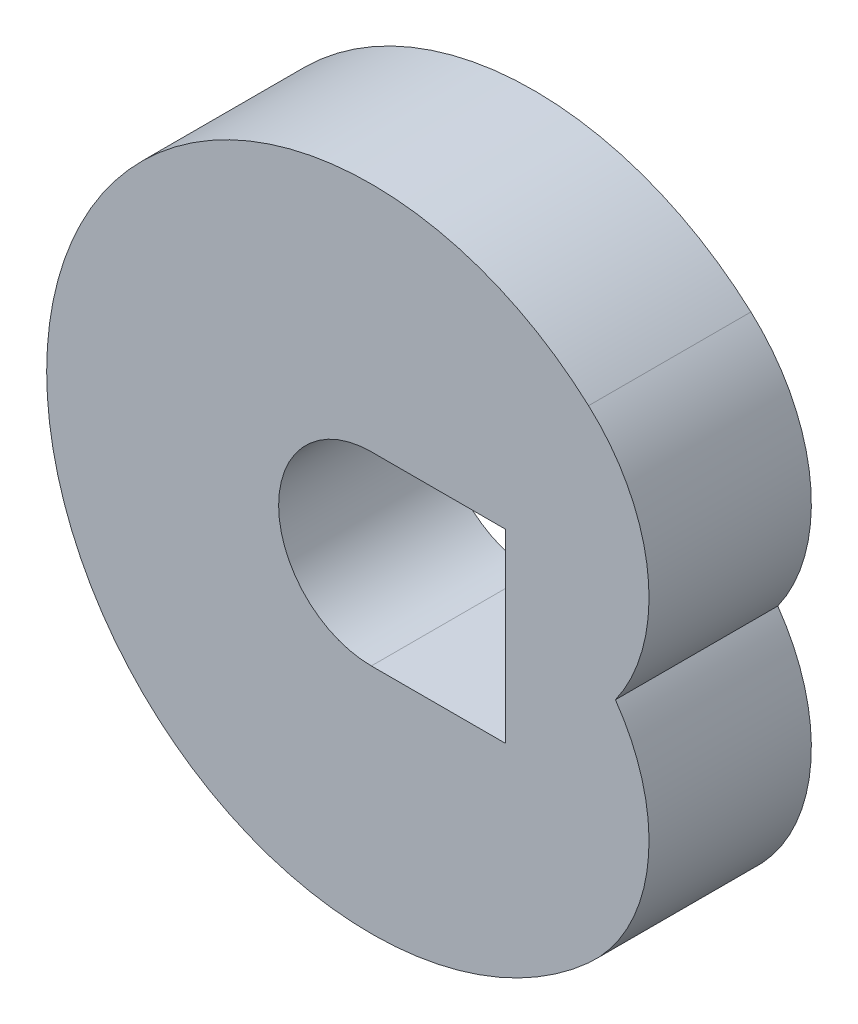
ISO-10303-21;
HEADER;
FILE_DESCRIPTION(('STEP AP214'),'2;1');
FILE_NAME('part.step','',(''),(''),'','','');
FILE_SCHEMA(('AUTOMOTIVE_DESIGN { 1 0 10303 214 1 1 1 1 }'));
ENDSEC;
DATA;
#1=APPLICATION_CONTEXT('core data for automotive mechanical design processes');
#2=APPLICATION_PROTOCOL_DEFINITION('international standard','automotive_design',2000,#1);
#3=PRODUCT_CONTEXT('',#1,'mechanical');
#4=PRODUCT('Part','Part','',(#3));
#5=PRODUCT_RELATED_PRODUCT_CATEGORY('part','',(#4));
#6=PRODUCT_DEFINITION_FORMATION('','',#4);
#7=PRODUCT_DEFINITION_CONTEXT('part definition',#1,'design');
#8=PRODUCT_DEFINITION('design','',#6,#7);
#9=PRODUCT_DEFINITION_SHAPE('','',#8);
#10=(LENGTH_UNIT() NAMED_UNIT(*) SI_UNIT(.MILLI.,.METRE.));
#11=(NAMED_UNIT(*) PLANE_ANGLE_UNIT() SI_UNIT($,.RADIAN.));
#12=(NAMED_UNIT(*) SI_UNIT($,.STERADIAN.) SOLID_ANGLE_UNIT());
#13=UNCERTAINTY_MEASURE_WITH_UNIT(LENGTH_MEASURE(1.E-05),#10,'distance_accuracy_value','');
#14=(GEOMETRIC_REPRESENTATION_CONTEXT(3) GLOBAL_UNCERTAINTY_ASSIGNED_CONTEXT((#13)) GLOBAL_UNIT_ASSIGNED_CONTEXT((#10,
#11,#12)) REPRESENTATION_CONTEXT('',''));
#15=CARTESIAN_POINT('',(0.,0.,0.));
#16=DIRECTION('',(0.,0.,1.));
#17=DIRECTION('',(1.,0.,0.));
#18=AXIS2_PLACEMENT_3D('',#15,#16,#17);
#19=CARTESIAN_POINT('',(234.195712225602,0.,400.));
#20=DIRECTION('',(0.,0.,-1.));
#21=DIRECTION('',(-1.,0.,0.));
#22=AXIS2_PLACEMENT_3D('',#19,#20,#21);
#23=PLANE('',#22);
#24=CARTESIAN_POINT('',(234.195712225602,260.100688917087,400.));
#25=DIRECTION('',(0.,0.,-1.));
#26=DIRECTION('',(-1.,0.,0.));
#27=AXIS2_PLACEMENT_3D('',#24,#25,#26);
#28=CIRCLE('',#27,450.);
#29=CARTESIAN_POINT('',(535.304485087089,594.515860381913,400.));
#30=VERTEX_POINT('',#29);
#31=CARTESIAN_POINT('',(601.411768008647,-1.11022302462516E-13,400.));
#32=VERTEX_POINT('',#31);
#33=EDGE_CURVE('E155',#30,#32,#28,.T.);
#34=ORIENTED_EDGE('',*,*,#33,.F.);
#35=CARTESIAN_POINT('',(0.,0.,400.));
#36=DIRECTION('',(0.,0.,1.));
#37=DIRECTION('',(1.,0.,0.));
#38=AXIS2_PLACEMENT_3D('',#35,#36,#37);
#39=CIRCLE('',#38,800.);
#40=CARTESIAN_POINT('',(535.304485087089,-594.515860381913,400.));
#41=VERTEX_POINT('',#40);
#42=EDGE_CURVE('E161',#30,#41,#39,.T.);
#43=ORIENTED_EDGE('',*,*,#42,.T.);
#44=CARTESIAN_POINT('',(234.195712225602,-260.100688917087,400.));
#45=DIRECTION('',(0.,0.,1.));
#46=DIRECTION('',(1.,0.,0.));
#47=AXIS2_PLACEMENT_3D('',#44,#45,#46);
#48=CIRCLE('',#47,450.);
#49=EDGE_CURVE('E158',#41,#32,#48,.T.);
#50=ORIENTED_EDGE('',*,*,#49,.T.);
#51=EDGE_LOOP('',(#34,#43,#50));
#52=FACE_BOUND('',#51,.T.);
#53=CARTESIAN_POINT('',(0.,0.,400.));
#54=DIRECTION('',(0.,0.,1.));
#55=DIRECTION('',(1.,0.,0.));
#56=AXIS2_PLACEMENT_3D('',#53,#54,#55);
#57=CIRCLE('',#56,228.477565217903);
#58=CARTESIAN_POINT('',(0.,228.477565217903,400.));
#59=VERTEX_POINT('',#58);
#60=CARTESIAN_POINT('',(0.,-228.477565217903,400.));
#61=VERTEX_POINT('',#60);
#62=EDGE_CURVE('E118',#59,#61,#57,.T.);
#63=ORIENTED_EDGE('',*,*,#62,.F.);
#64=DIRECTION('',(1.,0.,0.));
#65=VECTOR('',#64,1.);
#66=CARTESIAN_POINT('',(0.,228.477565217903,400.));
#67=LINE('',#66,#65);
#68=CARTESIAN_POINT('',(330.,228.477565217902,400.));
#69=VERTEX_POINT('',#68);
#70=EDGE_CURVE('E140',#59,#69,#67,.T.);
#71=ORIENTED_EDGE('',*,*,#70,.T.);
#72=DIRECTION('',(0.,-1.,0.));
#73=VECTOR('',#72,1.);
#74=CARTESIAN_POINT('',(330.,228.477565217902,400.));
#75=LINE('',#74,#73);
#76=CARTESIAN_POINT('',(330.,-228.477565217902,400.));
#77=VERTEX_POINT('',#76);
#78=EDGE_CURVE('E77',#69,#77,#75,.T.);
#79=ORIENTED_EDGE('',*,*,#78,.T.);
#80=DIRECTION('',(-1.,0.,0.));
#81=VECTOR('',#80,1.);
#82=CARTESIAN_POINT('',(330.,-228.477565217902,400.));
#83=LINE('',#82,#81);
#84=EDGE_CURVE('E128',#77,#61,#83,.T.);
#85=ORIENTED_EDGE('',*,*,#84,.T.);
#86=EDGE_LOOP('',(#63,#71,#79,#85));
#87=FACE_BOUND('',#86,.T.);
#88=ADVANCED_FACE('F60',(#52,#87),#23,.F.);
#89=CARTESIAN_POINT('',(234.195712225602,0.,0.));
#90=DIRECTION('',(0.,0.,-1.));
#91=DIRECTION('',(-1.,0.,0.));
#92=AXIS2_PLACEMENT_3D('',#89,#90,#91);
#93=PLANE('',#92);
#94=CARTESIAN_POINT('',(234.195712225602,260.100688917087,0.));
#95=DIRECTION('',(0.,0.,-1.));
#96=DIRECTION('',(-1.,0.,0.));
#97=AXIS2_PLACEMENT_3D('',#94,#95,#96);
#98=CIRCLE('',#97,450.);
#99=CARTESIAN_POINT('',(535.304485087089,594.515860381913,0.));
#100=VERTEX_POINT('',#99);
#101=CARTESIAN_POINT('',(601.411768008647,-1.11022302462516E-13,0.));
#102=VERTEX_POINT('',#101);
#103=EDGE_CURVE('E136',#100,#102,#98,.T.);
#104=ORIENTED_EDGE('',*,*,#103,.T.);
#105=CARTESIAN_POINT('',(234.195712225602,-260.100688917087,0.));
#106=DIRECTION('',(0.,0.,1.));
#107=DIRECTION('',(1.,0.,0.));
#108=AXIS2_PLACEMENT_3D('',#105,#106,#107);
#109=CIRCLE('',#108,450.);
#110=CARTESIAN_POINT('',(535.304485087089,-594.515860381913,0.));
#111=VERTEX_POINT('',#110);
#112=EDGE_CURVE('E165',#111,#102,#109,.T.);
#113=ORIENTED_EDGE('',*,*,#112,.F.);
#114=CARTESIAN_POINT('',(0.,0.,0.));
#115=DIRECTION('',(0.,0.,1.));
#116=DIRECTION('',(1.,0.,0.));
#117=AXIS2_PLACEMENT_3D('',#114,#115,#116);
#118=CIRCLE('',#117,800.);
#119=EDGE_CURVE('E159',#100,#111,#118,.T.);
#120=ORIENTED_EDGE('',*,*,#119,.F.);
#121=EDGE_LOOP('',(#104,#113,#120));
#122=FACE_BOUND('',#121,.T.);
#123=DIRECTION('',(1.,0.,0.));
#124=VECTOR('',#123,1.);
#125=CARTESIAN_POINT('',(0.,228.477565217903,0.));
#126=LINE('',#125,#124);
#127=CARTESIAN_POINT('',(0.,228.477565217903,0.));
#128=VERTEX_POINT('',#127);
#129=CARTESIAN_POINT('',(330.,228.477565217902,0.));
#130=VERTEX_POINT('',#129);
#131=EDGE_CURVE('E129',#128,#130,#126,.T.);
#132=ORIENTED_EDGE('',*,*,#131,.F.);
#133=CARTESIAN_POINT('',(0.,0.,0.));
#134=DIRECTION('',(0.,0.,1.));
#135=DIRECTION('',(1.,0.,0.));
#136=AXIS2_PLACEMENT_3D('',#133,#134,#135);
#137=CIRCLE('',#136,228.477565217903);
#138=CARTESIAN_POINT('',(0.,-228.477565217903,0.));
#139=VERTEX_POINT('',#138);
#140=EDGE_CURVE('E85',#128,#139,#137,.T.);
#141=ORIENTED_EDGE('',*,*,#140,.T.);
#142=DIRECTION('',(-1.,0.,0.));
#143=VECTOR('',#142,1.);
#144=CARTESIAN_POINT('',(330.,-228.477565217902,0.));
#145=LINE('',#144,#143);
#146=CARTESIAN_POINT('',(330.,-228.477565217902,0.));
#147=VERTEX_POINT('',#146);
#148=EDGE_CURVE('E135',#147,#139,#145,.T.);
#149=ORIENTED_EDGE('',*,*,#148,.F.);
#150=DIRECTION('',(0.,-1.,0.));
#151=VECTOR('',#150,1.);
#152=CARTESIAN_POINT('',(330.,228.477565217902,0.));
#153=LINE('',#152,#151);
#154=EDGE_CURVE('E146',#130,#147,#153,.T.);
#155=ORIENTED_EDGE('',*,*,#154,.F.);
#156=EDGE_LOOP('',(#132,#141,#149,#155));
#157=FACE_BOUND('',#156,.T.);
#158=ADVANCED_FACE('F180',(#122,#157),#93,.T.);
#159=CARTESIAN_POINT('',(234.195712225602,260.100688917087,400.));
#160=DIRECTION('',(0.,0.,-1.));
#161=DIRECTION('',(-1.,0.,0.));
#162=AXIS2_PLACEMENT_3D('',#159,#160,#161);
#163=CYLINDRICAL_SURFACE('',#162,450.);
#164=ORIENTED_EDGE('',*,*,#103,.F.);
#165=DIRECTION('',(0.,0.,-1.));
#166=VECTOR('',#165,1.);
#167=CARTESIAN_POINT('',(535.304485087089,594.515860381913,400.));
#168=LINE('',#167,#166);
#169=EDGE_CURVE('E12',#30,#100,#168,.T.);
#170=ORIENTED_EDGE('',*,*,#169,.F.);
#171=ORIENTED_EDGE('',*,*,#33,.T.);
#172=DIRECTION('',(0.,0.,-1.));
#173=VECTOR('',#172,1.);
#174=CARTESIAN_POINT('',(601.411768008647,-1.11022302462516E-13,400.));
#175=LINE('',#174,#173);
#176=EDGE_CURVE('E64',#32,#102,#175,.T.);
#177=ORIENTED_EDGE('',*,*,#176,.T.);
#178=EDGE_LOOP('',(#164,#170,#171,#177));
#179=FACE_BOUND('',#178,.T.);
#180=ADVANCED_FACE('F62',(#179),#163,.T.);
#181=CARTESIAN_POINT('',(0.,0.,400.));
#182=DIRECTION('',(0.,0.,-1.));
#183=DIRECTION('',(-1.,0.,0.));
#184=AXIS2_PLACEMENT_3D('',#181,#182,#183);
#185=CYLINDRICAL_SURFACE('',#184,800.);
#186=ORIENTED_EDGE('',*,*,#119,.T.);
#187=DIRECTION('',(0.,0.,-1.));
#188=VECTOR('',#187,1.);
#189=CARTESIAN_POINT('',(535.304485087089,-594.515860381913,400.));
#190=LINE('',#189,#188);
#191=EDGE_CURVE('E69',#41,#111,#190,.T.);
#192=ORIENTED_EDGE('',*,*,#191,.F.);
#193=ORIENTED_EDGE('',*,*,#42,.F.);
#194=ORIENTED_EDGE('',*,*,#169,.T.);
#195=EDGE_LOOP('',(#186,#192,#193,#194));
#196=FACE_BOUND('',#195,.T.);
#197=ADVANCED_FACE('F183',(#196),#185,.T.);
#198=CARTESIAN_POINT('',(234.195712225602,-260.100688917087,400.));
#199=DIRECTION('',(0.,0.,-1.));
#200=DIRECTION('',(-1.,0.,0.));
#201=AXIS2_PLACEMENT_3D('',#198,#199,#200);
#202=CYLINDRICAL_SURFACE('',#201,450.);
#203=ORIENTED_EDGE('',*,*,#112,.T.);
#204=ORIENTED_EDGE('',*,*,#176,.F.);
#205=ORIENTED_EDGE('',*,*,#49,.F.);
#206=ORIENTED_EDGE('',*,*,#191,.T.);
#207=EDGE_LOOP('',(#203,#204,#205,#206));
#208=FACE_BOUND('',#207,.T.);
#209=ADVANCED_FACE('F177',(#208),#202,.T.);
#210=CARTESIAN_POINT('',(0.,0.,400.));
#211=DIRECTION('',(0.,0.,-1.));
#212=DIRECTION('',(-1.,0.,0.));
#213=AXIS2_PLACEMENT_3D('',#210,#211,#212);
#214=CYLINDRICAL_SURFACE('',#213,228.477565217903);
#215=ORIENTED_EDGE('',*,*,#140,.F.);
#216=DIRECTION('',(0.,0.,-1.));
#217=VECTOR('',#216,1.);
#218=CARTESIAN_POINT('',(0.,228.477565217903,400.));
#219=LINE('',#218,#217);
#220=EDGE_CURVE('E123',#59,#128,#219,.T.);
#221=ORIENTED_EDGE('',*,*,#220,.F.);
#222=ORIENTED_EDGE('',*,*,#62,.T.);
#223=DIRECTION('',(0.,0.,-1.));
#224=VECTOR('',#223,1.);
#225=CARTESIAN_POINT('',(0.,-228.477565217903,400.));
#226=LINE('',#225,#224);
#227=EDGE_CURVE('E121',#61,#139,#226,.T.);
#228=ORIENTED_EDGE('',*,*,#227,.T.);
#229=EDGE_LOOP('',(#215,#221,#222,#228));
#230=FACE_BOUND('',#229,.T.);
#231=ADVANCED_FACE('F120',(#230),#214,.F.);
#232=CARTESIAN_POINT('',(330.,-228.477565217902,400.));
#233=DIRECTION('',(0.,-1.,0.));
#234=DIRECTION('',(1.,0.,0.));
#235=AXIS2_PLACEMENT_3D('',#232,#233,#234);
#236=PLANE('',#235);
#237=ORIENTED_EDGE('',*,*,#148,.T.);
#238=ORIENTED_EDGE('',*,*,#227,.F.);
#239=ORIENTED_EDGE('',*,*,#84,.F.);
#240=DIRECTION('',(0.,0.,-1.));
#241=VECTOR('',#240,1.);
#242=CARTESIAN_POINT('',(330.,-228.477565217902,400.));
#243=LINE('',#242,#241);
#244=EDGE_CURVE('E137',#77,#147,#243,.T.);
#245=ORIENTED_EDGE('',*,*,#244,.T.);
#246=EDGE_LOOP('',(#237,#238,#239,#245));
#247=FACE_BOUND('',#246,.T.);
#248=ADVANCED_FACE('F133',(#247),#236,.F.);
#249=CARTESIAN_POINT('',(330.,228.477565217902,400.));
#250=DIRECTION('',(1.,0.,0.));
#251=DIRECTION('',(0.,0.,-1.));
#252=AXIS2_PLACEMENT_3D('',#249,#250,#251);
#253=PLANE('',#252);
#254=ORIENTED_EDGE('',*,*,#154,.T.);
#255=ORIENTED_EDGE('',*,*,#244,.F.);
#256=ORIENTED_EDGE('',*,*,#78,.F.);
#257=DIRECTION('',(0.,0.,-1.));
#258=VECTOR('',#257,1.);
#259=CARTESIAN_POINT('',(330.,228.477565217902,400.));
#260=LINE('',#259,#258);
#261=EDGE_CURVE('E152',#69,#130,#260,.T.);
#262=ORIENTED_EDGE('',*,*,#261,.T.);
#263=EDGE_LOOP('',(#254,#255,#256,#262));
#264=FACE_BOUND('',#263,.T.);
#265=ADVANCED_FACE('F203',(#264),#253,.F.);
#266=CARTESIAN_POINT('',(0.,228.477565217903,400.));
#267=DIRECTION('',(0.,1.,0.));
#268=DIRECTION('',(-1.,0.,0.));
#269=AXIS2_PLACEMENT_3D('',#266,#267,#268);
#270=PLANE('',#269);
#271=ORIENTED_EDGE('',*,*,#131,.T.);
#272=ORIENTED_EDGE('',*,*,#261,.F.);
#273=ORIENTED_EDGE('',*,*,#70,.F.);
#274=ORIENTED_EDGE('',*,*,#220,.T.);
#275=EDGE_LOOP('',(#271,#272,#273,#274));
#276=FACE_BOUND('',#275,.T.);
#277=ADVANCED_FACE('F207',(#276),#270,.F.);
#278=CLOSED_SHELL('',(#88,#158,#180,#197,#209,#231,#248,#265,#277));
#279=MANIFOLD_SOLID_BREP('B2',#278);
#280=ADVANCED_BREP_SHAPE_REPRESENTATION('',(#18,#279),#14);
#281=SHAPE_DEFINITION_REPRESENTATION(#9,#280);
ENDSEC;
END-ISO-10303-21;
